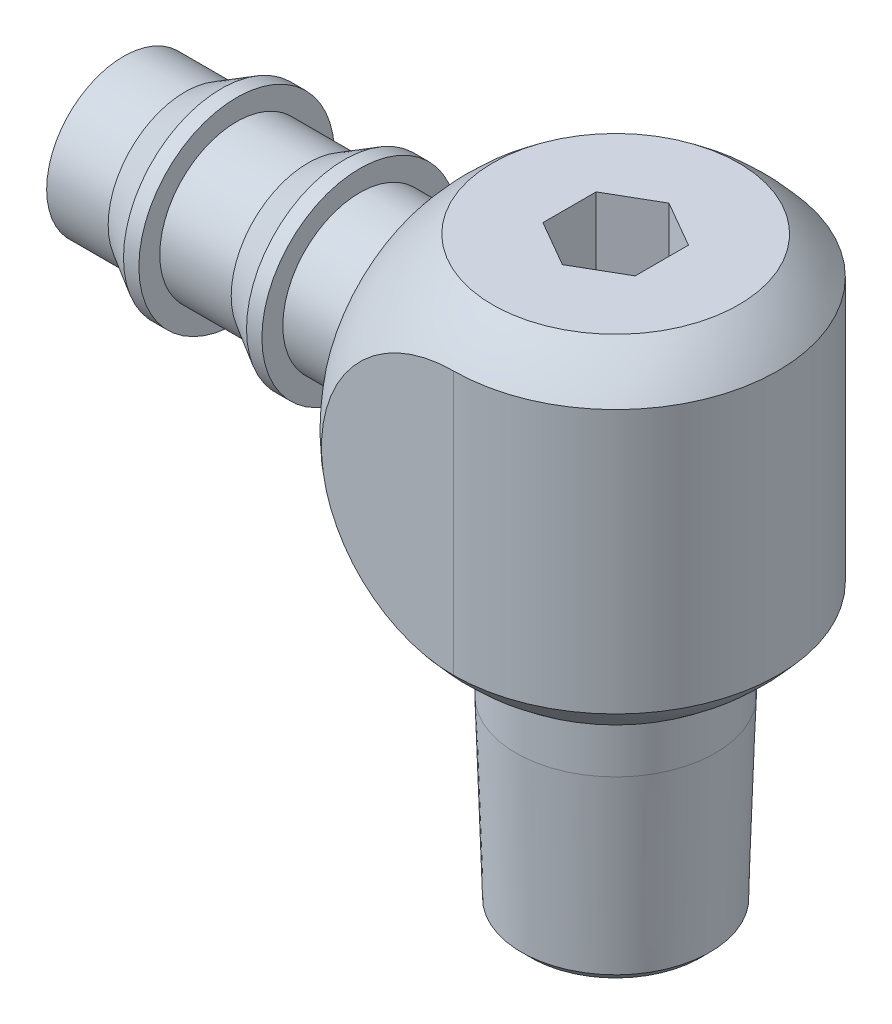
ISO-10303-21;
HEADER;
FILE_DESCRIPTION(('STEP AP214'),'2;1');
FILE_NAME('part.step','',(''),(''),'','','');
FILE_SCHEMA(('AUTOMOTIVE_DESIGN { 1 0 10303 214 1 1 1 1 }'));
ENDSEC;
DATA;
#1=APPLICATION_CONTEXT('core data for automotive mechanical design processes');
#2=APPLICATION_PROTOCOL_DEFINITION('international standard','automotive_design',2000,#1);
#3=PRODUCT_CONTEXT('',#1,'mechanical');
#4=PRODUCT('Part','Part','',(#3));
#5=PRODUCT_RELATED_PRODUCT_CATEGORY('part','',(#4));
#6=PRODUCT_DEFINITION_FORMATION('','',#4);
#7=PRODUCT_DEFINITION_CONTEXT('part definition',#1,'design');
#8=PRODUCT_DEFINITION('design','',#6,#7);
#9=PRODUCT_DEFINITION_SHAPE('','',#8);
#10=(LENGTH_UNIT() NAMED_UNIT(*) SI_UNIT(.MILLI.,.METRE.));
#11=(NAMED_UNIT(*) PLANE_ANGLE_UNIT() SI_UNIT($,.RADIAN.));
#12=(NAMED_UNIT(*) SI_UNIT($,.STERADIAN.) SOLID_ANGLE_UNIT());
#13=UNCERTAINTY_MEASURE_WITH_UNIT(LENGTH_MEASURE(1.E-05),#10,'distance_accuracy_value','');
#14=(GEOMETRIC_REPRESENTATION_CONTEXT(3) GLOBAL_UNCERTAINTY_ASSIGNED_CONTEXT((#13)) GLOBAL_UNIT_ASSIGNED_CONTEXT((#10,
#11,#12)) REPRESENTATION_CONTEXT('',''));
#15=CARTESIAN_POINT('',(0.,0.,0.));
#16=DIRECTION('',(0.,0.,1.));
#17=DIRECTION('',(1.,0.,0.));
#18=AXIS2_PLACEMENT_3D('',#15,#16,#17);
#19=CARTESIAN_POINT('',(-8.382,3.93065,8.382));
#20=DIRECTION('',(1.,0.,0.));
#21=DIRECTION('',(0.,0.,-1.));
#22=AXIS2_PLACEMENT_3D('',#19,#20,#21);
#23=PLANE('',#22);
#24=CARTESIAN_POINT('',(-8.382,14.72565,0.));
#25=DIRECTION('',(1.,0.,0.));
#26=DIRECTION('',(0.,0.,-1.));
#27=AXIS2_PLACEMENT_3D('',#24,#25,#26);
#28=CIRCLE('',#27,4.7625);
#29=CARTESIAN_POINT('',(-8.382,14.72565,-4.7625));
#30=VERTEX_POINT('',#29);
#31=EDGE_CURVE('E46',#30,#30,#28,.T.);
#32=ORIENTED_EDGE('',*,*,#31,.T.);
#33=EDGE_LOOP('',(#32));
#34=FACE_BOUND('',#33,.T.);
#35=CARTESIAN_POINT('',(-8.382,14.72565,0.));
#36=DIRECTION('',(1.,0.,0.));
#37=DIRECTION('',(0.,0.,-1.));
#38=AXIS2_PLACEMENT_3D('',#35,#36,#37);
#39=CIRCLE('',#38,6.80250696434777);
#40=CARTESIAN_POINT('',(-8.382,14.72565,-6.80250696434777));
#41=VERTEX_POINT('',#40);
#42=EDGE_CURVE('E249',#41,#41,#39,.F.);
#43=ORIENTED_EDGE('',*,*,#42,.T.);
#44=EDGE_LOOP('',(#43));
#45=FACE_BOUND('',#44,.T.);
#46=ADVANCED_FACE('F38',(#34,#45),#23,.F.);
#47=CARTESIAN_POINT('',(0.,14.72565,0.));
#48=DIRECTION('',(0.,-1.,0.));
#49=DIRECTION('',(-1.,0.,0.));
#50=AXIS2_PLACEMENT_3D('',#47,#48,#49);
#51=SPHERICAL_SURFACE('',#50,10.795);
#52=CARTESIAN_POINT('',(0.,5.9944,0.));
#53=DIRECTION('',(0.,-1.,0.));
#54=DIRECTION('',(0.,0.,-1.));
#55=AXIS2_PLACEMENT_3D('',#52,#53,#54);
#56=CIRCLE('',#55,6.34801531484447);
#57=CARTESIAN_POINT('',(0.,5.9944,-6.34801531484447));
#58=VERTEX_POINT('',#57);
#59=EDGE_CURVE('E261',#58,#58,#56,.F.);
#60=ORIENTED_EDGE('',*,*,#59,.T.);
#61=EDGE_LOOP('',(#60));
#62=FACE_BOUND('',#61,.T.);
#63=ORIENTED_EDGE('',*,*,#42,.F.);
#64=EDGE_LOOP('',(#63));
#65=FACE_BOUND('',#64,.T.);
#66=CARTESIAN_POINT('',(0.,14.72565,-8.382));
#67=DIRECTION('',(0.,0.,1.));
#68=DIRECTION('',(1.,0.,0.));
#69=AXIS2_PLACEMENT_3D('',#66,#67,#68);
#70=CIRCLE('',#69,6.80250696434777);
#71=CARTESIAN_POINT('',(0.,7.92314303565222,-8.382));
#72=VERTEX_POINT('',#71);
#73=CARTESIAN_POINT('',(0.,21.5281569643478,-8.382));
#74=VERTEX_POINT('',#73);
#75=EDGE_CURVE('E246',#72,#74,#70,.F.);
#76=ORIENTED_EDGE('',*,*,#75,.F.);
#77=CARTESIAN_POINT('',(0.,7.92314303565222,0.));
#78=DIRECTION('',(0.,1.,0.));
#79=DIRECTION('',(0.,0.,1.));
#80=AXIS2_PLACEMENT_3D('',#77,#78,#79);
#81=CIRCLE('',#80,8.382);
#82=CARTESIAN_POINT('',(0.,7.92314303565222,8.382));
#83=VERTEX_POINT('',#82);
#84=EDGE_CURVE('E237',#83,#72,#81,.T.);
#85=ORIENTED_EDGE('',*,*,#84,.F.);
#86=CARTESIAN_POINT('',(0.,14.72565,8.382));
#87=DIRECTION('',(0.,0.,-1.));
#88=DIRECTION('',(-1.,0.,0.));
#89=AXIS2_PLACEMENT_3D('',#86,#87,#88);
#90=CIRCLE('',#89,6.80250696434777);
#91=CARTESIAN_POINT('',(0.,21.5281569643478,8.382));
#92=VERTEX_POINT('',#91);
#93=EDGE_CURVE('E260',#92,#83,#90,.F.);
#94=ORIENTED_EDGE('',*,*,#93,.F.);
#95=CARTESIAN_POINT('',(0.,21.5281569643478,0.));
#96=DIRECTION('',(0.,-1.,0.));
#97=DIRECTION('',(0.,0.,-1.));
#98=AXIS2_PLACEMENT_3D('',#95,#96,#97);
#99=CIRCLE('',#98,8.382);
#100=EDGE_CURVE('E247',#74,#92,#99,.T.);
#101=ORIENTED_EDGE('',*,*,#100,.F.);
#102=EDGE_LOOP('',(#76,#85,#94,#101));
#103=FACE_BOUND('',#102,.T.);
#104=CARTESIAN_POINT('',(0.,23.4569,0.));
#105=DIRECTION('',(0.,1.,0.));
#106=DIRECTION('',(-1.,0.,0.));
#107=AXIS2_PLACEMENT_3D('',#104,#105,#106);
#108=CIRCLE('',#107,6.34801531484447);
#109=CARTESIAN_POINT('',(-6.34801531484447,23.4569,0.));
#110=VERTEX_POINT('',#109);
#111=EDGE_CURVE('E264',#110,#110,#108,.F.);
#112=ORIENTED_EDGE('',*,*,#111,.T.);
#113=EDGE_LOOP('',(#112));
#114=FACE_BOUND('',#113,.T.);
#115=ADVANCED_FACE('F206',(#62,#65,#103,#114),#51,.T.);
#116=CARTESIAN_POINT('',(0.,3.93065,-8.382));
#117=DIRECTION('',(0.,0.,1.));
#118=DIRECTION('',(1.,0.,0.));
#119=AXIS2_PLACEMENT_3D('',#116,#117,#118);
#120=PLANE('',#119);
#121=ORIENTED_EDGE('',*,*,#75,.T.);
#122=DIRECTION('',(0.,-1.,0.));
#123=VECTOR('',#122,1.);
#124=CARTESIAN_POINT('',(0.,3.93065,-8.382));
#125=LINE('',#124,#123);
#126=EDGE_CURVE('E240',#74,#72,#125,.T.);
#127=ORIENTED_EDGE('',*,*,#126,.T.);
#128=EDGE_LOOP('',(#121,#127));
#129=FACE_BOUND('',#128,.T.);
#130=ADVANCED_FACE('F212',(#129),#120,.F.);
#131=CARTESIAN_POINT('',(0.,3.93065,8.382));
#132=DIRECTION('',(0.,0.,-1.));
#133=DIRECTION('',(-1.,0.,0.));
#134=AXIS2_PLACEMENT_3D('',#131,#132,#133);
#135=PLANE('',#134);
#136=ORIENTED_EDGE('',*,*,#93,.T.);
#137=DIRECTION('',(0.,-1.,0.));
#138=VECTOR('',#137,1.);
#139=CARTESIAN_POINT('',(0.,3.93065,8.382));
#140=LINE('',#139,#138);
#141=EDGE_CURVE('E242',#92,#83,#140,.T.);
#142=ORIENTED_EDGE('',*,*,#141,.F.);
#143=EDGE_LOOP('',(#136,#142));
#144=FACE_BOUND('',#143,.T.);
#145=ADVANCED_FACE('F218',(#144),#135,.F.);
#146=CARTESIAN_POINT('',(0.,3.93065,0.));
#147=DIRECTION('',(0.,-1.,0.));
#148=DIRECTION('',(0.,0.,-1.));
#149=AXIS2_PLACEMENT_3D('',#146,#147,#148);
#150=CYLINDRICAL_SURFACE('',#149,8.382);
#151=ORIENTED_EDGE('',*,*,#84,.T.);
#152=ORIENTED_EDGE('',*,*,#126,.F.);
#153=ORIENTED_EDGE('',*,*,#100,.T.);
#154=ORIENTED_EDGE('',*,*,#141,.T.);
#155=EDGE_LOOP('',(#151,#152,#153,#154));
#156=FACE_BOUND('',#155,.T.);
#157=ADVANCED_FACE('F223',(#156),#150,.T.);
#158=CARTESIAN_POINT('',(-12.7,5.9944,-8.382));
#159=DIRECTION('',(0.,-1.,0.));
#160=DIRECTION('',(0.,0.,-1.));
#161=AXIS2_PLACEMENT_3D('',#158,#159,#160);
#162=PLANE('',#161);
#163=CARTESIAN_POINT('',(0.,5.9944,0.));
#164=DIRECTION('',(0.,-1.,0.));
#165=DIRECTION('',(0.,0.,-1.));
#166=AXIS2_PLACEMENT_3D('',#163,#164,#165);
#167=CIRCLE('',#166,5.1435);
#168=CARTESIAN_POINT('',(0.,5.9944,-5.1435));
#169=VERTEX_POINT('',#168);
#170=EDGE_CURVE('E12',#169,#169,#167,.T.);
#171=ORIENTED_EDGE('',*,*,#170,.F.);
#172=EDGE_LOOP('',(#171));
#173=FACE_BOUND('',#172,.T.);
#174=ORIENTED_EDGE('',*,*,#59,.F.);
#175=EDGE_LOOP('',(#174));
#176=FACE_BOUND('',#175,.T.);
#177=ADVANCED_FACE('F225',(#173,#176),#162,.T.);
#178=CARTESIAN_POINT('',(-12.7,23.4569,-8.382));
#179=DIRECTION('',(0.,1.,0.));
#180=DIRECTION('',(-1.,0.,0.));
#181=AXIS2_PLACEMENT_3D('',#178,#179,#180);
#182=PLANE('',#181);
#183=DIRECTION('',(-0.866025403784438,0.,-0.5));
#184=VECTOR('',#183,1.);
#185=CARTESIAN_POINT('',(2.38125,23.4569,-1.3748153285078));
#186=LINE('',#185,#184);
#187=CARTESIAN_POINT('',(2.38125,23.4569,-1.3748153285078));
#188=VERTEX_POINT('',#187);
#189=CARTESIAN_POINT('',(0.,23.4569,-2.74963065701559));
#190=VERTEX_POINT('',#189);
#191=EDGE_CURVE('E53',#188,#190,#186,.T.);
#192=ORIENTED_EDGE('',*,*,#191,.F.);
#193=DIRECTION('',(0.,0.,-1.));
#194=VECTOR('',#193,1.);
#195=CARTESIAN_POINT('',(2.38125,23.4569,1.3748153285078));
#196=LINE('',#195,#194);
#197=CARTESIAN_POINT('',(2.38125,23.4569,1.3748153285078));
#198=VERTEX_POINT('',#197);
#199=EDGE_CURVE('E127',#198,#188,#196,.T.);
#200=ORIENTED_EDGE('',*,*,#199,.F.);
#201=DIRECTION('',(0.866025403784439,0.,-0.5));
#202=VECTOR('',#201,1.);
#203=CARTESIAN_POINT('',(0.,23.4569,2.74963065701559));
#204=LINE('',#203,#202);
#205=CARTESIAN_POINT('',(0.,23.4569,2.74963065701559));
#206=VERTEX_POINT('',#205);
#207=EDGE_CURVE('E130',#206,#198,#204,.T.);
#208=ORIENTED_EDGE('',*,*,#207,.F.);
#209=DIRECTION('',(0.866025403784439,0.,0.5));
#210=VECTOR('',#209,1.);
#211=CARTESIAN_POINT('',(-2.38125,23.4569,1.3748153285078));
#212=LINE('',#211,#210);
#213=CARTESIAN_POINT('',(-2.38125,23.4569,1.3748153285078));
#214=VERTEX_POINT('',#213);
#215=EDGE_CURVE('E146',#214,#206,#212,.T.);
#216=ORIENTED_EDGE('',*,*,#215,.F.);
#217=DIRECTION('',(0.,0.,1.));
#218=VECTOR('',#217,1.);
#219=CARTESIAN_POINT('',(-2.38125,23.4569,-1.3748153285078));
#220=LINE('',#219,#218);
#221=CARTESIAN_POINT('',(-2.38125,23.4569,-1.3748153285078));
#222=VERTEX_POINT('',#221);
#223=EDGE_CURVE('E143',#222,#214,#220,.T.);
#224=ORIENTED_EDGE('',*,*,#223,.F.);
#225=DIRECTION('',(-0.866025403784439,0.,0.5));
#226=VECTOR('',#225,1.);
#227=CARTESIAN_POINT('',(0.,23.4569,-2.74963065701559));
#228=LINE('',#227,#226);
#229=EDGE_CURVE('E141',#190,#222,#228,.T.);
#230=ORIENTED_EDGE('',*,*,#229,.F.);
#231=EDGE_LOOP('',(#192,#200,#208,#216,#224,#230));
#232=FACE_BOUND('',#231,.T.);
#233=ORIENTED_EDGE('',*,*,#111,.F.);
#234=EDGE_LOOP('',(#233));
#235=FACE_BOUND('',#234,.T.);
#236=ADVANCED_FACE('F231',(#232,#235),#182,.T.);
#237=CARTESIAN_POINT('',(0.,14.72565,0.));
#238=DIRECTION('',(-1.,0.,0.));
#239=DIRECTION('',(0.,0.,1.));
#240=AXIS2_PLACEMENT_3D('',#237,#238,#239);
#241=CYLINDRICAL_SURFACE('',#240,3.96875);
#242=CARTESIAN_POINT('',(-9.17575,14.72565,0.));
#243=DIRECTION('',(1.,0.,0.));
#244=DIRECTION('',(0.,0.,-1.));
#245=AXIS2_PLACEMENT_3D('',#242,#243,#244);
#246=CIRCLE('',#245,3.96875);
#247=CARTESIAN_POINT('',(-9.17575,14.72565,-3.96875));
#248=VERTEX_POINT('',#247);
#249=EDGE_CURVE('E252',#248,#248,#246,.F.);
#250=ORIENTED_EDGE('',*,*,#249,.T.);
#251=EDGE_LOOP('',(#250));
#252=FACE_BOUND('',#251,.T.);
#253=CARTESIAN_POINT('',(-13.2115011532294,14.72565,0.));
#254=DIRECTION('',(-1.,0.,0.));
#255=DIRECTION('',(0.,0.,1.));
#256=AXIS2_PLACEMENT_3D('',#253,#254,#255);
#257=CIRCLE('',#256,3.96875);
#258=CARTESIAN_POINT('',(-13.2115011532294,14.72565,3.96875));
#259=VERTEX_POINT('',#258);
#260=EDGE_CURVE('E281',#259,#259,#257,.T.);
#261=ORIENTED_EDGE('',*,*,#260,.F.);
#262=EDGE_LOOP('',(#261));
#263=FACE_BOUND('',#262,.T.);
#264=ADVANCED_FACE('F274',(#252,#263),#241,.T.);
#265=CARTESIAN_POINT('',(0.,14.72565,0.));
#266=DIRECTION('',(-1.,0.,0.));
#267=DIRECTION('',(0.,0.,1.));
#268=AXIS2_PLACEMENT_3D('',#265,#266,#267);
#269=CYLINDRICAL_SURFACE('',#268,3.96875);
#270=CARTESIAN_POINT('',(-25.4,14.72565,0.));
#271=DIRECTION('',(-1.,0.,0.));
#272=DIRECTION('',(0.,0.,1.));
#273=AXIS2_PLACEMENT_3D('',#270,#271,#272);
#274=CIRCLE('',#273,3.96875);
#275=CARTESIAN_POINT('',(-25.4,14.72565,3.96875));
#276=VERTEX_POINT('',#275);
#277=EDGE_CURVE('E284',#276,#276,#274,.T.);
#278=ORIENTED_EDGE('',*,*,#277,.F.);
#279=EDGE_LOOP('',(#278));
#280=FACE_BOUND('',#279,.T.);
#281=CARTESIAN_POINT('',(-22.225,14.72565,0.));
#282=DIRECTION('',(-1.,0.,0.));
#283=DIRECTION('',(0.,0.,1.));
#284=AXIS2_PLACEMENT_3D('',#281,#282,#283);
#285=CIRCLE('',#284,3.96875);
#286=CARTESIAN_POINT('',(-22.225,14.72565,3.96875));
#287=VERTEX_POINT('',#286);
#288=EDGE_CURVE('E265',#287,#287,#285,.T.);
#289=ORIENTED_EDGE('',*,*,#288,.T.);
#290=EDGE_LOOP('',(#289));
#291=FACE_BOUND('',#290,.T.);
#292=ADVANCED_FACE('F277',(#280,#291),#269,.T.);
#293=CARTESIAN_POINT('',(-20.3552511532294,14.72565,0.));
#294=DIRECTION('',(1.,0.,0.));
#295=DIRECTION('',(0.,0.,-1.));
#296=AXIS2_PLACEMENT_3D('',#293,#294,#295);
#297=CONICAL_SURFACE('',#296,5.04825,0.523598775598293);
#298=ORIENTED_EDGE('',*,*,#288,.F.);
#299=EDGE_LOOP('',(#298));
#300=FACE_BOUND('',#299,.T.);
#301=CARTESIAN_POINT('',(-20.3552511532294,14.72565,0.));
#302=DIRECTION('',(-1.,0.,0.));
#303=DIRECTION('',(0.,0.,1.));
#304=AXIS2_PLACEMENT_3D('',#301,#302,#303);
#305=CIRCLE('',#304,5.04825);
#306=CARTESIAN_POINT('',(-20.3552511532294,14.72565,5.04825));
#307=VERTEX_POINT('',#306);
#308=EDGE_CURVE('E305',#307,#307,#305,.T.);
#309=ORIENTED_EDGE('',*,*,#308,.T.);
#310=EDGE_LOOP('',(#309));
#311=FACE_BOUND('',#310,.T.);
#312=ADVANCED_FACE('F314',(#300,#311),#297,.T.);
#313=CARTESIAN_POINT('',(0.,14.72565,0.));
#314=DIRECTION('',(-1.,0.,0.));
#315=DIRECTION('',(0.,0.,1.));
#316=AXIS2_PLACEMENT_3D('',#313,#314,#315);
#317=CYLINDRICAL_SURFACE('',#316,5.04825);
#318=ORIENTED_EDGE('',*,*,#308,.F.);
#319=EDGE_LOOP('',(#318));
#320=FACE_BOUND('',#319,.T.);
#321=CARTESIAN_POINT('',(-19.5615011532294,14.72565,0.));
#322=DIRECTION('',(-1.,0.,0.));
#323=DIRECTION('',(0.,0.,1.));
#324=AXIS2_PLACEMENT_3D('',#321,#322,#323);
#325=CIRCLE('',#324,5.04825);
#326=CARTESIAN_POINT('',(-19.5615011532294,14.72565,5.04825));
#327=VERTEX_POINT('',#326);
#328=EDGE_CURVE('E302',#327,#327,#325,.T.);
#329=ORIENTED_EDGE('',*,*,#328,.T.);
#330=EDGE_LOOP('',(#329));
#331=FACE_BOUND('',#330,.T.);
#332=ADVANCED_FACE('F317',(#320,#331),#317,.T.);
#333=CARTESIAN_POINT('',(-19.5615011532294,14.72565,-5.04825));
#334=DIRECTION('',(-1.,0.,0.));
#335=DIRECTION('',(0.,0.,1.));
#336=AXIS2_PLACEMENT_3D('',#333,#334,#335);
#337=PLANE('',#336);
#338=ORIENTED_EDGE('',*,*,#328,.F.);
#339=EDGE_LOOP('',(#338));
#340=FACE_BOUND('',#339,.T.);
#341=CARTESIAN_POINT('',(-19.5615011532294,14.72565,0.));
#342=DIRECTION('',(-1.,0.,0.));
#343=DIRECTION('',(0.,0.,1.));
#344=AXIS2_PLACEMENT_3D('',#341,#342,#343);
#345=CIRCLE('',#344,3.96875);
#346=CARTESIAN_POINT('',(-19.5615011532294,14.72565,3.96875));
#347=VERTEX_POINT('',#346);
#348=EDGE_CURVE('E299',#347,#347,#345,.T.);
#349=ORIENTED_EDGE('',*,*,#348,.T.);
#350=EDGE_LOOP('',(#349));
#351=FACE_BOUND('',#350,.T.);
#352=ADVANCED_FACE('F323',(#340,#351),#337,.F.);
#353=CARTESIAN_POINT('',(0.,14.72565,0.));
#354=DIRECTION('',(-1.,0.,0.));
#355=DIRECTION('',(0.,0.,1.));
#356=AXIS2_PLACEMENT_3D('',#353,#354,#355);
#357=CYLINDRICAL_SURFACE('',#356,3.96875);
#358=ORIENTED_EDGE('',*,*,#348,.F.);
#359=EDGE_LOOP('',(#358));
#360=FACE_BOUND('',#359,.T.);
#361=CARTESIAN_POINT('',(-15.875,14.72565,0.));
#362=DIRECTION('',(-1.,0.,0.));
#363=DIRECTION('',(0.,0.,1.));
#364=AXIS2_PLACEMENT_3D('',#361,#362,#363);
#365=CIRCLE('',#364,3.96875);
#366=CARTESIAN_POINT('',(-15.875,14.72565,3.96875));
#367=VERTEX_POINT('',#366);
#368=EDGE_CURVE('E296',#367,#367,#365,.T.);
#369=ORIENTED_EDGE('',*,*,#368,.T.);
#370=EDGE_LOOP('',(#369));
#371=FACE_BOUND('',#370,.T.);
#372=ADVANCED_FACE('F329',(#360,#371),#357,.T.);
#373=CARTESIAN_POINT('',(-14.0052511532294,14.72565,0.));
#374=DIRECTION('',(1.,0.,0.));
#375=DIRECTION('',(0.,0.,-1.));
#376=AXIS2_PLACEMENT_3D('',#373,#374,#375);
#377=CONICAL_SURFACE('',#376,5.04825,0.523598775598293);
#378=ORIENTED_EDGE('',*,*,#368,.F.);
#379=EDGE_LOOP('',(#378));
#380=FACE_BOUND('',#379,.T.);
#381=CARTESIAN_POINT('',(-14.0052511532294,14.72565,0.));
#382=DIRECTION('',(-1.,0.,0.));
#383=DIRECTION('',(0.,0.,1.));
#384=AXIS2_PLACEMENT_3D('',#381,#382,#383);
#385=CIRCLE('',#384,5.04825);
#386=CARTESIAN_POINT('',(-14.0052511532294,14.72565,5.04825));
#387=VERTEX_POINT('',#386);
#388=EDGE_CURVE('E287',#387,#387,#385,.T.);
#389=ORIENTED_EDGE('',*,*,#388,.T.);
#390=EDGE_LOOP('',(#389));
#391=FACE_BOUND('',#390,.T.);
#392=ADVANCED_FACE('F335',(#380,#391),#377,.T.);
#393=CARTESIAN_POINT('',(0.,14.72565,0.));
#394=DIRECTION('',(-1.,0.,0.));
#395=DIRECTION('',(0.,0.,1.));
#396=AXIS2_PLACEMENT_3D('',#393,#394,#395);
#397=CYLINDRICAL_SURFACE('',#396,5.04825);
#398=ORIENTED_EDGE('',*,*,#388,.F.);
#399=EDGE_LOOP('',(#398));
#400=FACE_BOUND('',#399,.T.);
#401=CARTESIAN_POINT('',(-13.2115011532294,14.72565,0.));
#402=DIRECTION('',(-1.,0.,0.));
#403=DIRECTION('',(0.,0.,1.));
#404=AXIS2_PLACEMENT_3D('',#401,#402,#403);
#405=CIRCLE('',#404,5.04825);
#406=CARTESIAN_POINT('',(-13.2115011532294,14.72565,5.04825));
#407=VERTEX_POINT('',#406);
#408=EDGE_CURVE('E283',#407,#407,#405,.T.);
#409=ORIENTED_EDGE('',*,*,#408,.T.);
#410=EDGE_LOOP('',(#409));
#411=FACE_BOUND('',#410,.T.);
#412=ADVANCED_FACE('F341',(#400,#411),#397,.T.);
#413=CARTESIAN_POINT('',(-13.2115011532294,14.72565,-5.04825));
#414=DIRECTION('',(-1.,0.,0.));
#415=DIRECTION('',(0.,0.,1.));
#416=AXIS2_PLACEMENT_3D('',#413,#414,#415);
#417=PLANE('',#416);
#418=ORIENTED_EDGE('',*,*,#408,.F.);
#419=EDGE_LOOP('',(#418));
#420=FACE_BOUND('',#419,.T.);
#421=ORIENTED_EDGE('',*,*,#260,.T.);
#422=EDGE_LOOP('',(#421));
#423=FACE_BOUND('',#422,.T.);
#424=ADVANCED_FACE('F347',(#420,#423),#417,.F.);
#425=CARTESIAN_POINT('',(-25.4,14.72565,0.));
#426=DIRECTION('',(1.,0.,0.));
#427=DIRECTION('',(0.,0.,-1.));
#428=AXIS2_PLACEMENT_3D('',#425,#426,#427);
#429=PLANE('',#428);
#430=CARTESIAN_POINT('',(-25.4,14.72565,0.));
#431=DIRECTION('',(-1.,0.,0.));
#432=DIRECTION('',(0.,0.,1.));
#433=AXIS2_PLACEMENT_3D('',#430,#431,#432);
#434=CIRCLE('',#433,2.69875);
#435=CARTESIAN_POINT('',(-25.4,14.72565,2.69875));
#436=VERTEX_POINT('',#435);
#437=EDGE_CURVE('E290',#436,#436,#434,.T.);
#438=ORIENTED_EDGE('',*,*,#437,.F.);
#439=EDGE_LOOP('',(#438));
#440=FACE_BOUND('',#439,.T.);
#441=ORIENTED_EDGE('',*,*,#277,.T.);
#442=EDGE_LOOP('',(#441));
#443=FACE_BOUND('',#442,.T.);
#444=ADVANCED_FACE('F271',(#440,#443),#429,.F.);
#445=CARTESIAN_POINT('',(-9.17575,14.72565,0.));
#446=DIRECTION('',(1.,0.,0.));
#447=DIRECTION('',(0.,0.,-1.));
#448=AXIS2_PLACEMENT_3D('',#445,#446,#447);
#449=TOROIDAL_SURFACE('',#448,4.7625,0.79375);
#450=ORIENTED_EDGE('',*,*,#31,.F.);
#451=EDGE_LOOP('',(#450));
#452=FACE_BOUND('',#451,.T.);
#453=ORIENTED_EDGE('',*,*,#249,.F.);
#454=EDGE_LOOP('',(#453));
#455=FACE_BOUND('',#454,.T.);
#456=ADVANCED_FACE('F40',(#452,#455),#449,.F.);
#457=CARTESIAN_POINT('',(7.63321770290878,14.72565,0.));
#458=DIRECTION('',(-1.,0.,0.));
#459=DIRECTION('',(0.,0.,1.));
#460=AXIS2_PLACEMENT_3D('',#457,#458,#459);
#461=CYLINDRICAL_SURFACE('',#460,2.69875);
#462=CARTESIAN_POINT('',(-1.67253503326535,14.72565,2.69875));
#463=CARTESIAN_POINT('',(-1.67255211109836,14.6336040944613,2.69874379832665));
#464=CARTESIAN_POINT('',(-1.68030737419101,14.5413935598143,2.69397876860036));
#465=CARTESIAN_POINT('',(-1.70965334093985,14.3600513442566,2.6754407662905));
#466=CARTESIAN_POINT('',(-1.73129393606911,14.2709319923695,2.6616353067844));
#467=CARTESIAN_POINT('',(-1.79559166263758,14.0620653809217,2.61886906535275));
#468=CARTESIAN_POINT('',(-1.84322459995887,13.9447005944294,2.58601902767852));
#469=CARTESIAN_POINT('',(-1.94924432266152,13.7196111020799,2.50708214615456));
#470=CARTESIAN_POINT('',(-2.00766742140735,13.611920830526,2.46095030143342));
#471=CARTESIAN_POINT('',(-2.11389977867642,13.4314134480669,2.36974043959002));
#472=CARTESIAN_POINT('',(-2.16068942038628,13.3566308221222,2.32730777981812));
#473=CARTESIAN_POINT('',(-2.25521327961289,13.2118402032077,2.23583843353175));
#474=CARTESIAN_POINT('',(-2.30294793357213,13.1418344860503,2.18679863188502));
#475=CARTESIAN_POINT('',(-2.44537137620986,12.9390900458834,2.02993736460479));
#476=CARTESIAN_POINT('',(-2.53948214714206,12.8133013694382,1.91221018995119));
#477=CARTESIAN_POINT('',(-2.69741005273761,12.6086236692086,1.67925509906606));
#478=CARTESIAN_POINT('',(-2.76334225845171,12.5255007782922,1.56915117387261));
#479=CARTESIAN_POINT('',(-2.88450697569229,12.3751171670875,1.33331317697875));
#480=CARTESIAN_POINT('',(-2.93975714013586,12.307830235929,1.20760546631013));
#481=CARTESIAN_POINT('',(-3.02669761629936,12.2029104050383,0.965996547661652));
#482=CARTESIAN_POINT('',(-3.06083309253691,12.1621279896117,0.852351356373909));
#483=CARTESIAN_POINT('',(-3.11664894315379,12.0957347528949,0.617756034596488));
#484=CARTESIAN_POINT('',(-3.13833661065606,12.0701150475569,0.496810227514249));
#485=CARTESIAN_POINT('',(-3.16756477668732,12.0356355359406,0.250255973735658));
#486=CARTESIAN_POINT('',(-3.17504030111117,12.0268527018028,0.12462877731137));
#487=CARTESIAN_POINT('',(-3.17495938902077,12.0269476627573,-0.126612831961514));
#488=CARTESIAN_POINT('',(-3.16740418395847,12.0358240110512,-0.252227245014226));
#489=CARTESIAN_POINT('',(-3.13906073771,12.0692617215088,-0.490120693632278));
#490=CARTESIAN_POINT('',(-3.11929320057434,12.0926136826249,-0.602698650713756));
#491=CARTESIAN_POINT('',(-3.06889165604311,12.1525228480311,-0.821684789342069));
#492=CARTESIAN_POINT('',(-3.03825594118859,12.1890821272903,-0.928091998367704));
#493=CARTESIAN_POINT('',(-2.96516187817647,12.2770863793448,-1.14109828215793));
#494=CARTESIAN_POINT('',(-2.92195926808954,12.3294810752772,-1.2470449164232));
#495=CARTESIAN_POINT('',(-2.82749393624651,12.4456326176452,-1.44856037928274));
#496=CARTESIAN_POINT('',(-2.77622492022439,12.509398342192,-1.54412100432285));
#497=CARTESIAN_POINT('',(-2.64107061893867,12.6806705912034,-1.76919838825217));
#498=CARTESIAN_POINT('',(-2.55361488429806,12.7941913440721,-1.89206722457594));
#499=CARTESIAN_POINT('',(-2.41868897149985,12.9779675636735,-2.05808234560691));
#500=CARTESIAN_POINT('',(-2.3730151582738,13.0415862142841,-2.11044056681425));
#501=CARTESIAN_POINT('',(-2.28147308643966,13.1732393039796,-2.20907783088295));
#502=CARTESIAN_POINT('',(-2.23560489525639,13.2412723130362,-2.25535882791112));
#503=CARTESIAN_POINT('',(-2.1202809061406,13.4198391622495,-2.36523523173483));
#504=CARTESIAN_POINT('',(-2.05150591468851,13.5334337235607,-2.42463084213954));
#505=CARTESIAN_POINT('',(-1.92271094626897,13.7719618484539,-2.52795441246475));
#506=CARTESIAN_POINT('',(-1.86266516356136,13.8968601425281,-2.5719285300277));
#507=CARTESIAN_POINT('',(-1.78077698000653,14.1096800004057,-2.62887122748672));
#508=CARTESIAN_POINT('',(-1.75306179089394,14.1938255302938,-2.64728021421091));
#509=CARTESIAN_POINT('',(-1.70870062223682,14.3662363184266,-2.67613043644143));
#510=CARTESIAN_POINT('',(-1.69202667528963,14.4544905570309,-2.68659181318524));
#511=CARTESIAN_POINT('',(-1.67265387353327,14.6340682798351,-2.69870532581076));
#512=CARTESIAN_POINT('',(-1.67008779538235,14.7254128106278,-2.70027376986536));
#513=CARTESIAN_POINT('',(-1.67988247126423,14.9070145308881,-2.69418627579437));
#514=CARTESIAN_POINT('',(-1.69225897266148,14.9972704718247,-2.68652060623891));
#515=CARTESIAN_POINT('',(-1.73315001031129,15.191766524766,-2.66035549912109));
#516=CARTESIAN_POINT('',(-1.76442210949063,15.2951431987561,-2.63997856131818));
#517=CARTESIAN_POINT('',(-1.83863516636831,15.4950102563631,-2.58883374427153));
#518=CARTESIAN_POINT('',(-1.88161671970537,15.5914751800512,-2.55802962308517));
#519=CARTESIAN_POINT('',(-1.96594760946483,15.7610019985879,-2.49358880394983));
#520=CARTESIAN_POINT('',(-2.00623298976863,15.8351790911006,-2.46142489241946));
#521=CARTESIAN_POINT('',(-2.08936635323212,15.979262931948,-2.39126158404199));
#522=CARTESIAN_POINT('',(-2.13221586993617,16.0491670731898,-2.35325867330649));
#523=CARTESIAN_POINT('',(-2.21905453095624,16.1849481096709,-2.27155980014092));
#524=CARTESIAN_POINT('',(-2.26304496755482,16.2508201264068,-2.22785713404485));
#525=CARTESIAN_POINT('',(-2.35099285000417,16.3785061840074,-2.13484329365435));
#526=CARTESIAN_POINT('',(-2.39495029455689,16.4403200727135,-2.08553190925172));
#527=CARTESIAN_POINT('',(-2.48370497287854,16.5622876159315,-1.97909980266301));
#528=CARTESIAN_POINT('',(-2.52845989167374,16.6222623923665,-1.92173801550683));
#529=CARTESIAN_POINT('',(-2.61591794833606,16.7373786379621,-1.80087889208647));
#530=CARTESIAN_POINT('',(-2.65862069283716,16.7925191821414,-1.73738038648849));
#531=CARTESIAN_POINT('',(-2.74088519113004,16.8973147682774,-1.60445089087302));
#532=CARTESIAN_POINT('',(-2.78045536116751,16.9469846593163,-1.53503691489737));
#533=CARTESIAN_POINT('',(-2.85559156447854,17.0403412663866,-1.39027931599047));
#534=CARTESIAN_POINT('',(-2.89115808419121,17.0840287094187,-1.31493641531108));
#535=CARTESIAN_POINT('',(-2.96948570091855,17.1795188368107,-1.12971481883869));
#536=CARTESIAN_POINT('',(-3.01006724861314,17.2283781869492,-1.01734187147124));
#537=CARTESIAN_POINT('',(-3.0791618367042,17.3110665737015,-0.783710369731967));
#538=CARTESIAN_POINT('',(-3.10768386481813,17.3449068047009,-0.662458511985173));
#539=CARTESIAN_POINT('',(-3.15055802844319,17.3956367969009,-0.413138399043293));
#540=CARTESIAN_POINT('',(-3.16482128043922,17.4124202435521,-0.285032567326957));
#541=CARTESIAN_POINT('',(-3.17750938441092,17.4273549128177,-0.026963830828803));
#542=CARTESIAN_POINT('',(-3.17593964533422,17.4255124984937,0.102998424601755));
#543=CARTESIAN_POINT('',(-3.15805196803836,17.4044450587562,0.347774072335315));
#544=CARTESIAN_POINT('',(-3.14316138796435,17.3869022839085,0.46284593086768));
#545=CARTESIAN_POINT('',(-3.10172582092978,17.3378332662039,0.687755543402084));
#546=CARTESIAN_POINT('',(-3.07517832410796,17.3063040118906,0.797592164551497));
#547=CARTESIAN_POINT('',(-3.01075529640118,17.2291965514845,1.01457139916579));
#548=CARTESIAN_POINT('',(-2.97242869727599,17.183056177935,1.12137726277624));
#549=CARTESIAN_POINT('',(-2.88722384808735,17.0792763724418,1.32545171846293));
#550=CARTESIAN_POINT('',(-2.84034344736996,17.0216340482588,1.42271790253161));
#551=CARTESIAN_POINT('',(-2.71605399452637,16.8663791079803,1.6516059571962));
#552=CARTESIAN_POINT('',(-2.63481467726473,16.7628851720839,1.7772179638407));
#553=CARTESIAN_POINT('',(-2.50765715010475,16.5944236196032,1.9486940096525));
#554=CARTESIAN_POINT('',(-2.46427045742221,16.535899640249,2.0031463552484));
#555=CARTESIAN_POINT('',(-2.37662732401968,16.4146570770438,2.10638022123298));
#556=CARTESIAN_POINT('',(-2.33237124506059,16.3519402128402,2.15516404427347));
#557=CARTESIAN_POINT('',(-2.24309983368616,16.2211289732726,2.24796735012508));
#558=CARTESIAN_POINT('',(-2.19808683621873,16.1529526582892,2.29187325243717));
#559=CARTESIAN_POINT('',(-2.10940838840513,16.0122046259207,2.37374405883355));
#560=CARTESIAN_POINT('',(-2.06574372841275,15.939630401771,2.41170552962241));
#561=CARTESIAN_POINT('',(-1.98162010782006,15.7901911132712,2.48128395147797));
#562=CARTESIAN_POINT('',(-1.94114788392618,15.7133463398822,2.5129280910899));
#563=CARTESIAN_POINT('',(-1.86549790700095,15.554835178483,2.569585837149));
#564=CARTESIAN_POINT('',(-1.83031224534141,15.4731762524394,2.59460939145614));
#565=CARTESIAN_POINT('',(-1.76840670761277,15.3052577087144,2.63718971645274));
#566=CARTESIAN_POINT('',(-1.74164334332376,15.2190245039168,2.65478500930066));
#567=CARTESIAN_POINT('',(-1.70017397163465,15.0425924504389,2.68154268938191));
#568=CARTESIAN_POINT('',(-1.68541613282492,14.9524124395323,2.69074134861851));
#569=CARTESIAN_POINT('',(-1.67621364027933,14.8389420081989,2.69646684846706));
#570=CARTESIAN_POINT('',(-1.67483830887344,14.8163192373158,2.69732149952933));
#571=CARTESIAN_POINT('',(-1.67299678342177,14.7710176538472,2.69846391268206));
#572=CARTESIAN_POINT('',(-1.67253082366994,14.7483388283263,2.69875152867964));
#573=CARTESIAN_POINT('',(-1.67253503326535,14.72565,2.69875));
#574=B_SPLINE_CURVE_WITH_KNOTS('',3,(#462,#463,#464,#465,#466,#467,#468,#469,#470,#471,#472,
#473,#474,#475,#476,#477,#478,#479,#480,#481,#482,#483,#484,#485,#486,#487,#488,#489,#490,#491,
#492,#493,#494,#495,#496,#497,#498,#499,#500,#501,#502,#503,#504,#505,#506,#507,#508,#509,#510,
#511,#512,#513,#514,#515,#516,#517,#518,#519,#520,#521,#522,#523,#524,#525,#526,#527,#528,#529,
#530,#531,#532,#533,#534,#535,#536,#537,#538,#539,#540,#541,#542,#543,#544,#545,#546,#547,#548,
#549,#550,#551,#552,#553,#554,#555,#556,#557,#558,#559,#560,#561,#562,#563,#564,#565,#566,#567,
#568,#569,#570,#571,#572,#573),.UNSPECIFIED.,.T.,.F.,(4,2,2,2,2,2,2,2,2,2,2,2,2,2,2,2,2,2,2,2,2,
2,2,2,2,2,2,2,2,2,2,2,2,2,2,2,2,2,2,2,2,2,2,2,2,2,2,2,2,2,2,2,2,2,2,4),(0.,0.276033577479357,
0.553064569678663,0.943409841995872,1.33509355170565,1.62840237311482,1.92184997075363,
2.50751524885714,2.96462159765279,3.4209659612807,3.79583793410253,4.17049004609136,
4.54685088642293,4.92318089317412,5.27166019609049,5.62019427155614,5.99633605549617,
6.37277281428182,6.935802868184,7.21820755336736,7.50052120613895,7.93575012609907,
8.36966502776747,8.64026299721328,8.91017289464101,9.18261876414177,9.4553520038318,
9.78324326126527,10.1122860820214,10.3829361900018,10.6537498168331,10.9248848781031,
11.1960300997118,11.478567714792,11.761159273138,12.0429638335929,12.3247341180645,
12.7103529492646,13.0956838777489,13.4834021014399,13.8709878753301,14.2214410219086,
14.5719696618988,14.9380788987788,15.3042803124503,15.846818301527,16.1194850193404,
16.3920405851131,16.6699976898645,16.9481147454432,17.2250077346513,17.5014822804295,
17.7765049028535,18.0503337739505,18.1183570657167,18.1863978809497),.UNSPECIFIED.);
#575=CARTESIAN_POINT('',(-3.17499999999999,17.4244,0.));
#576=VERTEX_POINT('',#575);
#577=EDGE_CURVE('E162',#576,#576,#574,.T.);
#578=ORIENTED_EDGE('',*,*,#577,.T.);
#579=EDGE_LOOP('',(#578));
#580=FACE_BOUND('',#579,.T.);
#581=ORIENTED_EDGE('',*,*,#437,.T.);
#582=EDGE_LOOP('',(#581));
#583=FACE_BOUND('',#582,.T.);
#584=ADVANCED_FACE('F173',(#580,#583),#461,.F.);
#585=CARTESIAN_POINT('',(0.,-6.7056,0.));
#586=DIRECTION('',(0.,1.,0.));
#587=DIRECTION('',(0.,0.,1.));
#588=AXIS2_PLACEMENT_3D('',#585,#586,#587);
#589=CONICAL_SURFACE('',#588,4.3815,0.785398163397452);
#590=CARTESIAN_POINT('',(0.,-6.22627568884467,0.));
#591=DIRECTION('',(0.,-1.,0.));
#592=DIRECTION('',(0.,0.,-1.));
#593=AXIS2_PLACEMENT_3D('',#590,#591,#592);
#594=CIRCLE('',#593,4.86082431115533);
#595=CARTESIAN_POINT('',(0.,-6.22627568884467,-4.86082431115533));
#596=VERTEX_POINT('',#595);
#597=EDGE_CURVE('E613',#596,#596,#594,.T.);
#598=ORIENTED_EDGE('',*,*,#597,.T.);
#599=EDGE_LOOP('',(#598));
#600=FACE_BOUND('',#599,.T.);
#601=CARTESIAN_POINT('',(0.,-6.7056,0.));
#602=DIRECTION('',(0.,-1.,0.));
#603=DIRECTION('',(0.,0.,-1.));
#604=AXIS2_PLACEMENT_3D('',#601,#602,#603);
#605=CIRCLE('',#604,4.3815);
#606=CARTESIAN_POINT('',(0.,-6.7056,-4.3815));
#607=VERTEX_POINT('',#606);
#608=EDGE_CURVE('E171',#607,#607,#605,.T.);
#609=ORIENTED_EDGE('',*,*,#608,.F.);
#610=EDGE_LOOP('',(#609));
#611=FACE_BOUND('',#610,.T.);
#612=ADVANCED_FACE('F195',(#600,#611),#589,.T.);
#613=CARTESIAN_POINT('',(0.,-6.22627568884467,0.));
#614=DIRECTION('',(0.,1.,0.));
#615=DIRECTION('',(0.,0.,1.));
#616=AXIS2_PLACEMENT_3D('',#613,#614,#615);
#617=CONICAL_SURFACE('',#616,4.86082431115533,0.0312396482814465);
#618=CARTESIAN_POINT('',(0.,2.8194,0.));
#619=DIRECTION('',(0.,-1.,0.));
#620=DIRECTION('',(0.,0.,-1.));
#621=AXIS2_PLACEMENT_3D('',#618,#619,#620);
#622=CIRCLE('',#621,5.1435);
#623=CARTESIAN_POINT('',(0.,2.8194,-5.1435));
#624=VERTEX_POINT('',#623);
#625=EDGE_CURVE('E614',#624,#624,#622,.T.);
#626=ORIENTED_EDGE('',*,*,#625,.T.);
#627=EDGE_LOOP('',(#626));
#628=FACE_BOUND('',#627,.T.);
#629=ORIENTED_EDGE('',*,*,#597,.F.);
#630=EDGE_LOOP('',(#629));
#631=FACE_BOUND('',#630,.T.);
#632=ADVANCED_FACE('F192',(#628,#631),#617,.T.);
#633=CARTESIAN_POINT('',(0.,-15.7116060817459,0.));
#634=DIRECTION('',(0.,-1.,0.));
#635=DIRECTION('',(0.,0.,-1.));
#636=AXIS2_PLACEMENT_3D('',#633,#634,#635);
#637=CYLINDRICAL_SURFACE('',#636,5.1435);
#638=ORIENTED_EDGE('',*,*,#170,.T.);
#639=EDGE_LOOP('',(#638));
#640=FACE_BOUND('',#639,.T.);
#641=ORIENTED_EDGE('',*,*,#625,.F.);
#642=EDGE_LOOP('',(#641));
#643=FACE_BOUND('',#642,.T.);
#644=ADVANCED_FACE('F188',(#640,#643),#637,.T.);
#645=CARTESIAN_POINT('',(0.,-6.7056,0.));
#646=DIRECTION('',(0.,-1.,0.));
#647=DIRECTION('',(0.,0.,-1.));
#648=AXIS2_PLACEMENT_3D('',#645,#646,#647);
#649=PLANE('',#648);
#650=CARTESIAN_POINT('',(0.,-6.7056,0.));
#651=DIRECTION('',(0.,-1.,0.));
#652=DIRECTION('',(0.,0.,-1.));
#653=AXIS2_PLACEMENT_3D('',#650,#651,#652);
#654=CIRCLE('',#653,3.17499999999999);
#655=CARTESIAN_POINT('',(0.,-6.7056,-3.17499999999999));
#656=VERTEX_POINT('',#655);
#657=EDGE_CURVE('E153',#656,#656,#654,.T.);
#658=ORIENTED_EDGE('',*,*,#657,.F.);
#659=EDGE_LOOP('',(#658));
#660=FACE_BOUND('',#659,.T.);
#661=ORIENTED_EDGE('',*,*,#608,.T.);
#662=EDGE_LOOP('',(#661));
#663=FACE_BOUND('',#662,.T.);
#664=ADVANCED_FACE('F183',(#660,#663),#649,.T.);
#665=CARTESIAN_POINT('',(0.,17.4244,0.));
#666=DIRECTION('',(0.,-1.,0.));
#667=DIRECTION('',(0.,0.,-1.));
#668=AXIS2_PLACEMENT_3D('',#665,#666,#667);
#669=CYLINDRICAL_SURFACE('',#668,3.17499999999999);
#670=ORIENTED_EDGE('',*,*,#657,.T.);
#671=EDGE_LOOP('',(#670));
#672=FACE_BOUND('',#671,.T.);
#673=CARTESIAN_POINT('',(0.,17.4244,0.));
#674=DIRECTION('',(0.,-1.,0.));
#675=DIRECTION('',(0.,0.,-1.));
#676=AXIS2_PLACEMENT_3D('',#673,#674,#675);
#677=CIRCLE('',#676,3.17499999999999);
#678=EDGE_CURVE('E60',#576,#576,#677,.T.);
#679=ORIENTED_EDGE('',*,*,#678,.F.);
#680=ORIENTED_EDGE('',*,*,#577,.F.);
#681=EDGE_LOOP('',(#679,#680));
#682=FACE_BOUND('',#681,.T.);
#683=ADVANCED_FACE('F177',(#672,#682),#669,.F.);
#684=CARTESIAN_POINT('',(0.,17.4244,0.));
#685=DIRECTION('',(0.,-1.,0.));
#686=DIRECTION('',(0.,0.,-1.));
#687=AXIS2_PLACEMENT_3D('',#684,#685,#686);
#688=PLANE('',#687);
#689=ORIENTED_EDGE('',*,*,#678,.T.);
#690=EDGE_LOOP('',(#689));
#691=FACE_BOUND('',#690,.T.);
#692=ADVANCED_FACE('F182',(#691),#688,.T.);
#693=CARTESIAN_POINT('',(2.38125,19.48815,-1.3748153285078));
#694=DIRECTION('',(0.5,0.,-0.866025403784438));
#695=DIRECTION('',(-0.866025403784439,0.,-0.5));
#696=AXIS2_PLACEMENT_3D('',#693,#694,#695);
#697=PLANE('',#696);
#698=ORIENTED_EDGE('',*,*,#191,.T.);
#699=DIRECTION('',(0.,1.,0.));
#700=VECTOR('',#699,1.);
#701=CARTESIAN_POINT('',(0.,19.48815,-2.74963065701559));
#702=LINE('',#701,#700);
#703=CARTESIAN_POINT('',(0.,19.48815,-2.74963065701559));
#704=VERTEX_POINT('',#703);
#705=EDGE_CURVE('E104',#704,#190,#702,.T.);
#706=ORIENTED_EDGE('',*,*,#705,.F.);
#707=DIRECTION('',(-0.866025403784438,0.,-0.5));
#708=VECTOR('',#707,1.);
#709=CARTESIAN_POINT('',(2.38125,19.48815,-1.3748153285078));
#710=LINE('',#709,#708);
#711=CARTESIAN_POINT('',(2.38125,19.48815,-1.3748153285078));
#712=VERTEX_POINT('',#711);
#713=EDGE_CURVE('E108',#712,#704,#710,.T.);
#714=ORIENTED_EDGE('',*,*,#713,.F.);
#715=DIRECTION('',(0.,1.,0.));
#716=VECTOR('',#715,1.);
#717=CARTESIAN_POINT('',(2.38125,19.48815,-1.3748153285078));
#718=LINE('',#717,#716);
#719=EDGE_CURVE('E151',#712,#188,#718,.T.);
#720=ORIENTED_EDGE('',*,*,#719,.T.);
#721=EDGE_LOOP('',(#698,#706,#714,#720));
#722=FACE_BOUND('',#721,.T.);
#723=ADVANCED_FACE('F106',(#722),#697,.F.);
#724=CARTESIAN_POINT('',(2.38125,19.48815,1.3748153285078));
#725=DIRECTION('',(1.,0.,0.));
#726=DIRECTION('',(0.,0.,-1.));
#727=AXIS2_PLACEMENT_3D('',#724,#725,#726);
#728=PLANE('',#727);
#729=ORIENTED_EDGE('',*,*,#199,.T.);
#730=ORIENTED_EDGE('',*,*,#719,.F.);
#731=DIRECTION('',(0.,0.,-1.));
#732=VECTOR('',#731,1.);
#733=CARTESIAN_POINT('',(2.38125,19.48815,1.3748153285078));
#734=LINE('',#733,#732);
#735=CARTESIAN_POINT('',(2.38125,19.48815,1.3748153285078));
#736=VERTEX_POINT('',#735);
#737=EDGE_CURVE('E114',#736,#712,#734,.T.);
#738=ORIENTED_EDGE('',*,*,#737,.F.);
#739=DIRECTION('',(0.,1.,0.));
#740=VECTOR('',#739,1.);
#741=CARTESIAN_POINT('',(2.38125,19.48815,1.3748153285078));
#742=LINE('',#741,#740);
#743=EDGE_CURVE('E154',#736,#198,#742,.T.);
#744=ORIENTED_EDGE('',*,*,#743,.T.);
#745=EDGE_LOOP('',(#729,#730,#738,#744));
#746=FACE_BOUND('',#745,.T.);
#747=ADVANCED_FACE('F380',(#746),#728,.F.);
#748=CARTESIAN_POINT('',(0.,19.48815,2.74963065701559));
#749=DIRECTION('',(0.5,0.,0.866025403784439));
#750=DIRECTION('',(0.866025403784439,0.,-0.5));
#751=AXIS2_PLACEMENT_3D('',#748,#749,#750);
#752=PLANE('',#751);
#753=ORIENTED_EDGE('',*,*,#207,.T.);
#754=ORIENTED_EDGE('',*,*,#743,.F.);
#755=DIRECTION('',(0.866025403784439,0.,-0.5));
#756=VECTOR('',#755,1.);
#757=CARTESIAN_POINT('',(0.,19.48815,2.74963065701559));
#758=LINE('',#757,#756);
#759=CARTESIAN_POINT('',(0.,19.48815,2.74963065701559));
#760=VERTEX_POINT('',#759);
#761=EDGE_CURVE('E137',#760,#736,#758,.T.);
#762=ORIENTED_EDGE('',*,*,#761,.F.);
#763=DIRECTION('',(0.,1.,0.));
#764=VECTOR('',#763,1.);
#765=CARTESIAN_POINT('',(0.,19.48815,2.74963065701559));
#766=LINE('',#765,#764);
#767=EDGE_CURVE('E156',#760,#206,#766,.T.);
#768=ORIENTED_EDGE('',*,*,#767,.T.);
#769=EDGE_LOOP('',(#753,#754,#762,#768));
#770=FACE_BOUND('',#769,.T.);
#771=ADVANCED_FACE('F378',(#770),#752,.F.);
#772=CARTESIAN_POINT('',(-2.38125,19.48815,1.3748153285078));
#773=DIRECTION('',(-0.5,0.,0.866025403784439));
#774=DIRECTION('',(0.866025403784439,0.,0.5));
#775=AXIS2_PLACEMENT_3D('',#772,#773,#774);
#776=PLANE('',#775);
#777=ORIENTED_EDGE('',*,*,#215,.T.);
#778=ORIENTED_EDGE('',*,*,#767,.F.);
#779=DIRECTION('',(0.866025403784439,0.,0.5));
#780=VECTOR('',#779,1.);
#781=CARTESIAN_POINT('',(-2.38125,19.48815,1.3748153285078));
#782=LINE('',#781,#780);
#783=CARTESIAN_POINT('',(-2.38125,19.48815,1.3748153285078));
#784=VERTEX_POINT('',#783);
#785=EDGE_CURVE('E134',#784,#760,#782,.T.);
#786=ORIENTED_EDGE('',*,*,#785,.F.);
#787=DIRECTION('',(0.,1.,0.));
#788=VECTOR('',#787,1.);
#789=CARTESIAN_POINT('',(-2.38125,19.48815,1.3748153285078));
#790=LINE('',#789,#788);
#791=EDGE_CURVE('E158',#784,#214,#790,.T.);
#792=ORIENTED_EDGE('',*,*,#791,.T.);
#793=EDGE_LOOP('',(#777,#778,#786,#792));
#794=FACE_BOUND('',#793,.T.);
#795=ADVANCED_FACE('F376',(#794),#776,.F.);
#796=CARTESIAN_POINT('',(-2.38125,19.48815,-1.3748153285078));
#797=DIRECTION('',(-1.,0.,0.));
#798=DIRECTION('',(0.,0.,1.));
#799=AXIS2_PLACEMENT_3D('',#796,#797,#798);
#800=PLANE('',#799);
#801=ORIENTED_EDGE('',*,*,#223,.T.);
#802=ORIENTED_EDGE('',*,*,#791,.F.);
#803=DIRECTION('',(0.,0.,1.));
#804=VECTOR('',#803,1.);
#805=CARTESIAN_POINT('',(-2.38125,19.48815,-1.3748153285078));
#806=LINE('',#805,#804);
#807=CARTESIAN_POINT('',(-2.38125,19.48815,-1.3748153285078));
#808=VERTEX_POINT('',#807);
#809=EDGE_CURVE('E122',#808,#784,#806,.T.);
#810=ORIENTED_EDGE('',*,*,#809,.F.);
#811=DIRECTION('',(0.,1.,0.));
#812=VECTOR('',#811,1.);
#813=CARTESIAN_POINT('',(-2.38125,19.48815,-1.3748153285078));
#814=LINE('',#813,#812);
#815=EDGE_CURVE('E113',#808,#222,#814,.T.);
#816=ORIENTED_EDGE('',*,*,#815,.T.);
#817=EDGE_LOOP('',(#801,#802,#810,#816));
#818=FACE_BOUND('',#817,.T.);
#819=ADVANCED_FACE('F372',(#818),#800,.F.);
#820=CARTESIAN_POINT('',(0.,19.48815,-2.74963065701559));
#821=DIRECTION('',(-0.5,0.,-0.866025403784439));
#822=DIRECTION('',(-0.866025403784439,0.,0.5));
#823=AXIS2_PLACEMENT_3D('',#820,#821,#822);
#824=PLANE('',#823);
#825=ORIENTED_EDGE('',*,*,#229,.T.);
#826=ORIENTED_EDGE('',*,*,#815,.F.);
#827=DIRECTION('',(-0.866025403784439,0.,0.5));
#828=VECTOR('',#827,1.);
#829=CARTESIAN_POINT('',(0.,19.48815,-2.74963065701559));
#830=LINE('',#829,#828);
#831=EDGE_CURVE('E117',#704,#808,#830,.T.);
#832=ORIENTED_EDGE('',*,*,#831,.F.);
#833=ORIENTED_EDGE('',*,*,#705,.T.);
#834=EDGE_LOOP('',(#825,#826,#832,#833));
#835=FACE_BOUND('',#834,.T.);
#836=ADVANCED_FACE('F118',(#835),#824,.F.);
#837=CARTESIAN_POINT('',(0.,19.48815,-2.74963065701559));
#838=DIRECTION('',(0.,1.,0.));
#839=DIRECTION('',(0.,0.,1.));
#840=AXIS2_PLACEMENT_3D('',#837,#838,#839);
#841=PLANE('',#840);
#842=ORIENTED_EDGE('',*,*,#713,.T.);
#843=ORIENTED_EDGE('',*,*,#831,.T.);
#844=ORIENTED_EDGE('',*,*,#809,.T.);
#845=ORIENTED_EDGE('',*,*,#785,.T.);
#846=ORIENTED_EDGE('',*,*,#761,.T.);
#847=ORIENTED_EDGE('',*,*,#737,.T.);
#848=EDGE_LOOP('',(#842,#843,#844,#845,#846,#847));
#849=FACE_BOUND('',#848,.T.);
#850=ADVANCED_FACE('F124',(#849),#841,.T.);
#851=CLOSED_SHELL('',(#46,#115,#130,#145,#157,#177,#236,#264,#292,#312,#332,#352,#372,#392,#412,
#424,#444,#456,#584,#612,#632,#644,#664,#683,#692,#723,#747,#771,#795,#819,#836,#850));
#852=MANIFOLD_SOLID_BREP('B2',#851);
#853=ADVANCED_BREP_SHAPE_REPRESENTATION('',(#18,#852),#14);
#854=SHAPE_DEFINITION_REPRESENTATION(#9,#853);
ENDSEC;
END-ISO-10303-21;
